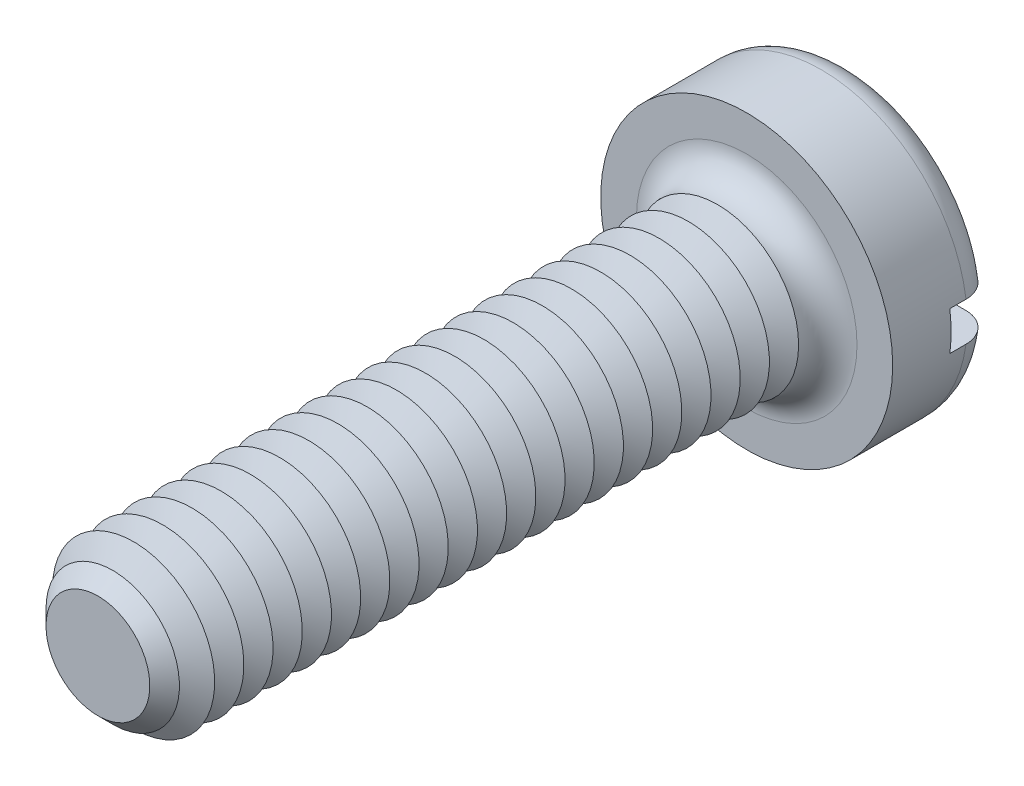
from build123d import *

# Parameters (mm, degrees)
SKETCH3_R           = 2.25
BOSS_EXTRUDE2_DEPTH = 1.6
SKETCH4_R           = 1.25
BOSS_EXTRUDE3_DEPTH = 10
FILLET1_R           = 0.45
CHAMFER1_SIZE       = 0.45
LPATTERN1_COUNT     = 21
LPATTERN1_PITCH     = 0.45
SKETCH8_W           = 4.5
SKETCH8_H           = 0.6
CUT_EXTRUDE1_DEPTH  = 0.7


with BuildPart() as part:
    # Sketch3 → Boss-Extrude2 (new body)
    with BuildSketch(Plane.XY):
        Circle(SKETCH3_R)
    extrude(amount=-BOSS_EXTRUDE2_DEPTH)

    # Sketch4 → Boss-Extrude3 (add)
    with BuildSketch(Plane.XY):
        Circle(SKETCH4_R)
    extrude(amount=BOSS_EXTRUDE3_DEPTH)

    # Fillet1
    fillet1_edges = [part.edges().sort_by_distance(p)[0] for p in [
        (-2.25, 0, -1.6),
        (-1.25, 0, 0),
    ]]
    fillet(fillet1_edges, radius=FILLET1_R)

    # Chamfer1
    chamfer1_edges = [part.edges().sort_by_distance(p)[0] for p in [
        (-1.25, 0, 10),
    ]]
    chamfer(chamfer1_edges, length=CHAMFER1_SIZE)

    # Sketch6 → Cut-Revolve1 (revolve, cut)
    with BuildSketch(Plane(origin=(0, 0, 0), x_dir=(0, 0, -1), z_dir=(1, 0, 0)), mode=Mode.PRIVATE) as cut_revolve1_sk:
        Polygon((-0.45, 1.25), (-0.675, 0.860288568), (-0.9, 1.25), align=None)
    cut_revolve1 = revolve(cut_revolve1_sk.sketch.rotate(Axis((0, 0, -1.694361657), (0, 0, 1)), 90), axis=Axis((0, 0, -1.694361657), (0, 0, 1)), mode=Mode.SUBTRACT)

    # LPattern1: Cut-Revolve1 ×21
    with Locations(*[(0, 0, i * LPATTERN1_PITCH) for i in range(1, LPATTERN1_COUNT)]):
        add(cut_revolve1, mode=Mode.SUBTRACT)

    # Sketch8 → Cut-Extrude1 (cut)
    with BuildSketch(Plane(origin=(0, 0, -1.6), x_dir=(-1, 0, 0), z_dir=(0, 0, -1))):
        Rectangle(SKETCH8_W, SKETCH8_H)
    extrude(amount=-CUT_EXTRUDE1_DEPTH, mode=Mode.SUBTRACT)


solid = part.part
